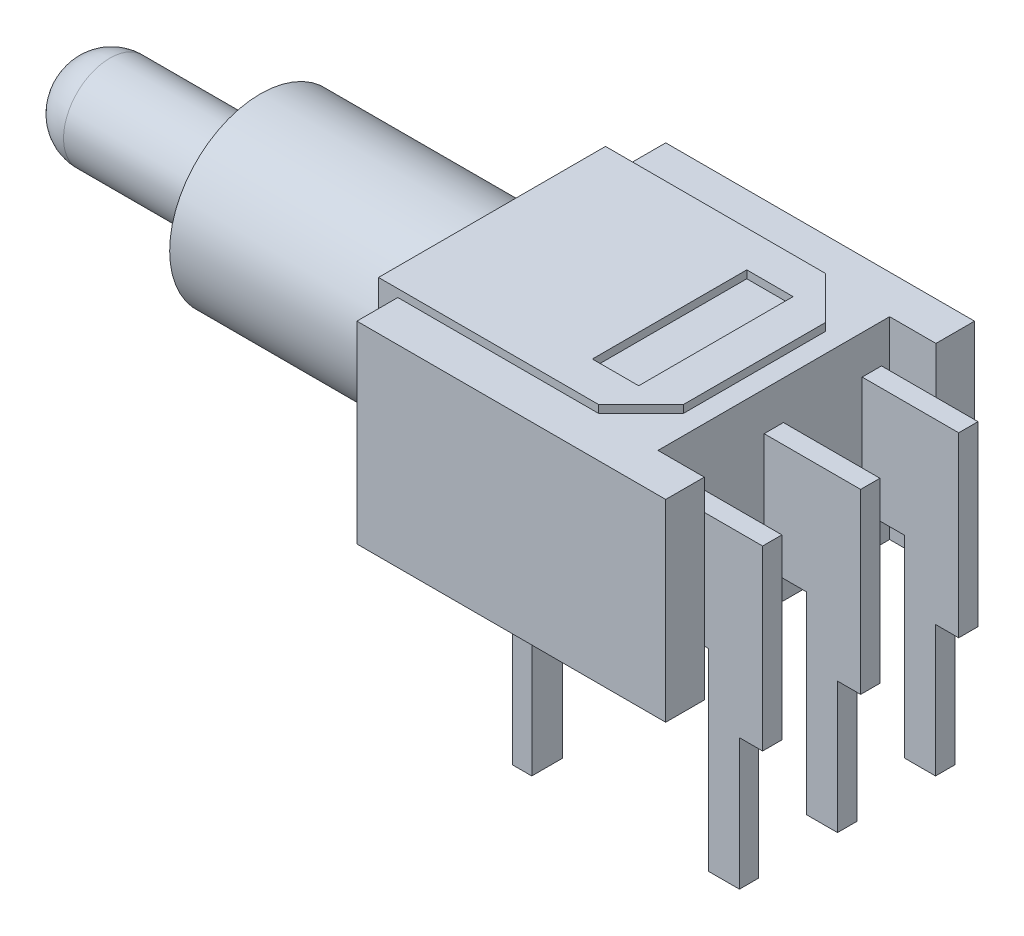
from build123d import *

# Parameters (mm, degrees)
BOSS_EXTRU_1_DEPTH         = 5
BOSS_EXTRU_2_DEPTH         = 0.25
BOSS_EXTRU_3_DEPTH         = 2.94
ESQUISSE6_W                = 4.28
ESQUISSE6_H                = 4
ENL_V_MAT_EXTRU_1_DEPTH    = 0.7
ESQUISSE7_R                = 2.35
ESQUISSE7_R_2              = 1.85
BOSS_EXTRU_4_DEPTH         = 6
ESQUISSE8_R                = 1.2
BOSS_EXTRU_5_DEPTH         = 11
CONG_1_R                   = 1.1
ESQUISSE9_W                = 1.2
ESQUISSE9_H                = 4
BOSS_EXTRU_6_DEPTH         = 0.2
R_P_TITION_LIN_AIRE1_COUNT = 2
R_P_TITION_LIN_AIRE1_PITCH = 2.54
R_P_TITION_LIN_AIRE2_COUNT = 2
R_P_TITION_LIN_AIRE2_PITCH = 2.54


with BuildPart() as part:
    # Esquisse1 → Boss.-Extru.1 (new body)
    with BuildSketch(Plane(origin=(0, 0, 0), x_dir=(1, 0, 0), z_dir=(0, 1, 0))):
        Polygon((0, 0), (8, 0), (8, 1), (6.8, 1), (6.8, 7), (8, 7), (8, 8), (0, 8), align=None)
    extrude(amount=BOSS_EXTRU_1_DEPTH)

    # Esquisse4 → Boss.-Extru.2 (add, symmetric)
    with BuildSketch(Plane.XY.offset(-4)):
        Polygon((6.8, 4), (6.8, 1), (7.9, 1), (7.9, -4), (8.7, -4), (8.7, -0.6), (9.3, -0.6), (9.3, 4), align=None)
    boss_extru_2 = extrude(amount=BOSS_EXTRU_2_DEPTH, both=True)

    # Esquisse5 → Boss.-Extru.3 (add, symmetric)
    with BuildSketch(Plane.XY.offset(-4)):
        with BuildLine():
            Line((0, 5.2), (0, 0))
            Line((0, 0), (2.77, 0))
            ThreePointArc((2.77, 0), (3.264974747, -0.205025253), (3.47, -0.7))
            Line((3.47, -0.7), (3.47, -4))
            Line((3.47, -4), (2.97, -4))
            Line((2.97, -4), (2.97, -0.7))
            ThreePointArc((2.97, -0.7), (2.911421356, -0.558578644), (2.77, -0.5))
            Line((2.77, -0.5), (-0.2, -0.5))
            ThreePointArc((-0.2, -0.5), (-0.412132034, -0.412132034), (-0.5, -0.2))
            Line((-0.5, -0.2), (-0.5, 5.2))
            Line((-0.5, 5.2), (0, 5.2))
        make_face()
    extrude(amount=BOSS_EXTRU_3_DEPTH, both=True)

    # Esquisse6 → Enl_v. mat.-Extru.1 (cut)
    with BuildSketch(Plane(origin=(3.47, 0, 0), x_dir=(0, 0, -1), z_dir=(1, 0, 0))):
        with Locations((4, -2)):
            Rectangle(ESQUISSE6_W, ESQUISSE6_H)
    extrude(amount=-ENL_V_MAT_EXTRU_1_DEPTH, mode=Mode.SUBTRACT)

    # Esquisse7 → Boss.-Extru.4 (add)
    with BuildSketch(Plane.ZY.offset(0.5)):
        with Locations(Location((-4, 2.5, 0), (0, 0, 90))):
            Circle(ESQUISSE7_R)
        with Locations(Location((-4, 2.5, 0), (0, 0, 270))):
            Circle(ESQUISSE7_R_2, mode=Mode.SUBTRACT)
    extrude(amount=BOSS_EXTRU_4_DEPTH)

    # Esquisse8 → Boss.-Extru.5 (add)
    with BuildSketch(Plane.ZY.offset(0.5)):
        with Locations(Location((-4, 2.5, 0), (0, 0, 90))):
            Circle(ESQUISSE8_R)
    extrude(amount=BOSS_EXTRU_5_DEPTH)

    # Cong_1
    cong_1_edges = [part.edges().sort_by_distance(p)[0] for p in [
        (-11.5, 1.3, -4),
    ]]
    fillet(cong_1_edges, radius=CONG_1_R)

    # Esquisse9 → Boss.-Extru.6 (add)
    with BuildSketch(Plane(origin=(0, 5, 0), x_dir=(1, 0, 0), z_dir=(0, 1, 0))):
        Polygon((0, 6.94), (5.2, 6.94), (6.3, 5.84), (6.3, 2.16), (5.2, 1.06), (0, 1.06), align=None)
        with Locations((4.7, 4)):
            Rectangle(ESQUISSE9_W, ESQUISSE9_H, mode=Mode.SUBTRACT)
    extrude(amount=BOSS_EXTRU_6_DEPTH)

    # R_p_tition lin_aire1: Boss.-Extru.2 ×2
    with Locations(*[(0, 0, -i * R_P_TITION_LIN_AIRE1_PITCH) for i in range(1, R_P_TITION_LIN_AIRE1_COUNT)]):
        add(boss_extru_2)

    # R_p_tition lin_aire2: Boss.-Extru.2 ×2
    with Locations(*[(0, 0, i * R_P_TITION_LIN_AIRE2_PITCH) for i in range(1, R_P_TITION_LIN_AIRE2_COUNT)]):
        add(boss_extru_2)


solid = part.part
